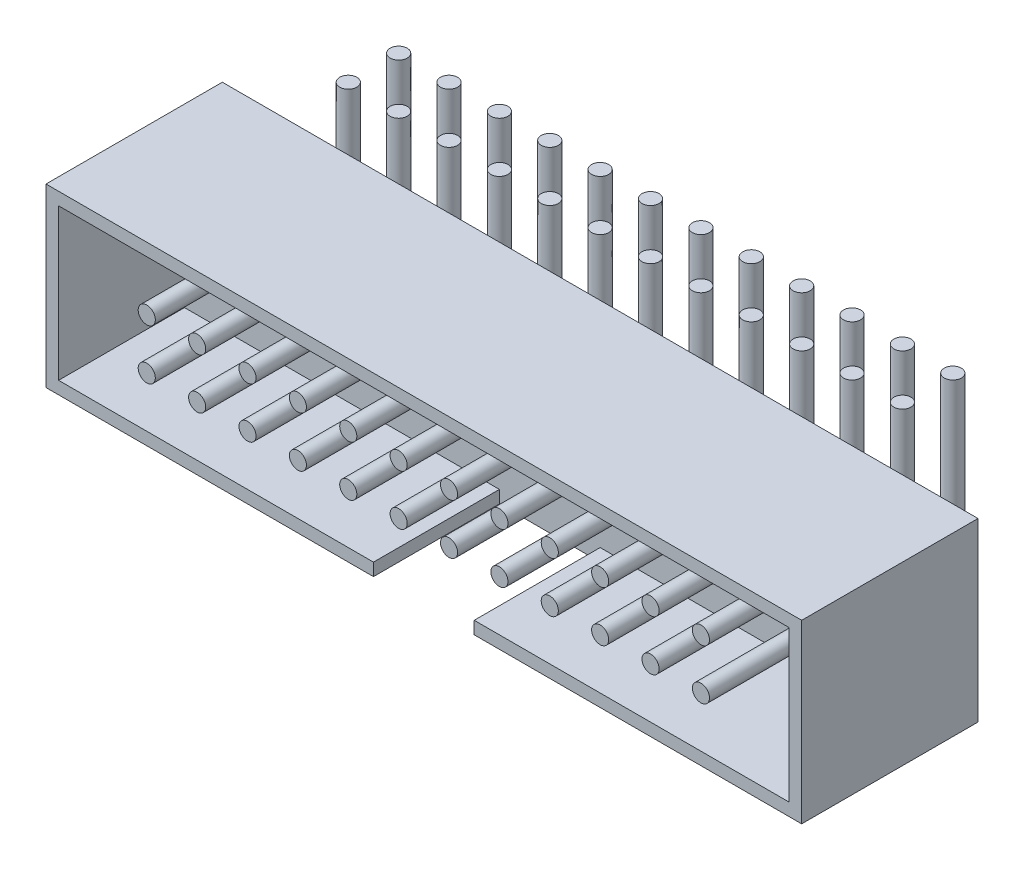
from build123d import *

# Parameters (mm, degrees)
SKETCH1_W                   = 38.1
SKETCH1_H                   = 8.89
BOSS_EXTRUDE1_DEPTH         = 2.54
SKETCH4_W                   = 0.635
SKETCH4_H                   = 8.89
BOSS_EXTRUDE2_DEPTH         = 6.35
SKETCH5_W                   = 36.83
SKETCH5_H                   = 0.635
SKETCH5_W_2                 = 15.875
BOSS_EXTRUDE3_DEPTH         = 6.35
BOSS_EXTRUDE4_DEPTH         = 3.81
BOSS_EXTRUDE4_DEPTH_BACK    = 8.89
SKETCH6_R                   = 0.4318
BOSS_EXTRUDE4_2_DEPTH       = 3.81
BOSS_EXTRUDE4_2_DEPTH_BACK  = 8.89
BOSS_EXTRUDE4_3_DEPTH       = 3.81
BOSS_EXTRUDE4_3_DEPTH_BACK  = 8.89
BOSS_EXTRUDE4_4_DEPTH       = 3.81
BOSS_EXTRUDE4_4_DEPTH_BACK  = 8.89
BOSS_EXTRUDE4_5_DEPTH       = 3.81
BOSS_EXTRUDE4_5_DEPTH_BACK  = 8.89
BOSS_EXTRUDE4_6_DEPTH       = 3.81
BOSS_EXTRUDE4_6_DEPTH_BACK  = 8.89
BOSS_EXTRUDE4_7_DEPTH       = 3.81
BOSS_EXTRUDE4_7_DEPTH_BACK  = 8.89
BOSS_EXTRUDE4_8_DEPTH       = 3.81
BOSS_EXTRUDE4_8_DEPTH_BACK  = 8.89
BOSS_EXTRUDE4_9_DEPTH       = 3.81
BOSS_EXTRUDE4_9_DEPTH_BACK  = 8.89
BOSS_EXTRUDE4_10_DEPTH      = 3.81
BOSS_EXTRUDE4_10_DEPTH_BACK = 8.89
BOSS_EXTRUDE4_11_DEPTH      = 3.81
BOSS_EXTRUDE4_11_DEPTH_BACK = 8.89
BOSS_EXTRUDE4_12_DEPTH      = 3.81
BOSS_EXTRUDE4_12_DEPTH_BACK = 8.89
BOSS_EXTRUDE5_DEPTH         = 1.27
BOSS_EXTRUDE5_DEPTH_BACK    = 8.89
SKETCH7_R                   = 0.4318
BOSS_EXTRUDE5_2_DEPTH       = 1.27
BOSS_EXTRUDE5_2_DEPTH_BACK  = 8.89
BOSS_EXTRUDE5_3_DEPTH       = 1.27
BOSS_EXTRUDE5_3_DEPTH_BACK  = 8.89
BOSS_EXTRUDE5_4_DEPTH       = 1.27
BOSS_EXTRUDE5_4_DEPTH_BACK  = 8.89
BOSS_EXTRUDE5_5_DEPTH       = 1.27
BOSS_EXTRUDE5_5_DEPTH_BACK  = 8.89
BOSS_EXTRUDE5_6_DEPTH       = 1.27
BOSS_EXTRUDE5_6_DEPTH_BACK  = 8.89
BOSS_EXTRUDE5_7_DEPTH       = 1.27
BOSS_EXTRUDE5_7_DEPTH_BACK  = 8.89
BOSS_EXTRUDE5_8_DEPTH       = 1.27
BOSS_EXTRUDE5_8_DEPTH_BACK  = 8.89
BOSS_EXTRUDE5_9_DEPTH       = 1.27
BOSS_EXTRUDE5_9_DEPTH_BACK  = 8.89
BOSS_EXTRUDE5_10_DEPTH      = 1.27
BOSS_EXTRUDE5_10_DEPTH_BACK = 8.89
BOSS_EXTRUDE5_11_DEPTH      = 1.27
BOSS_EXTRUDE5_11_DEPTH_BACK = 8.89
BOSS_EXTRUDE5_12_DEPTH      = 1.27
BOSS_EXTRUDE5_12_DEPTH_BACK = 8.89
F_3DSKETCH3_R               = 0.4318
BOSS_EXTRUDE6_DEPTH         = 7.62
BOSS_EXTRUDE6_2_DEPTH       = 7.62
BOSS_EXTRUDE6_3_DEPTH       = 7.62
BOSS_EXTRUDE6_4_DEPTH       = 7.62
BOSS_EXTRUDE6_5_DEPTH       = 7.62
BOSS_EXTRUDE6_6_DEPTH       = 7.62
BOSS_EXTRUDE6_7_DEPTH       = 7.62
BOSS_EXTRUDE6_8_DEPTH       = 7.62
BOSS_EXTRUDE6_9_DEPTH       = 7.62
BOSS_EXTRUDE6_10_DEPTH      = 7.62
BOSS_EXTRUDE6_11_DEPTH      = 7.62
BOSS_EXTRUDE6_12_DEPTH      = 7.62
DOME9_FACE_RADIUS           = 0.4318
DOME9_HEIGHT                = 0.4318
DOME10_FACE_RADIUS          = 0.4318
DOME10_HEIGHT               = 0.4318
DOME11_FACE_RADIUS          = 0.4318
DOME11_HEIGHT               = 0.4318
DOME12_FACE_RADIUS          = 0.4318
DOME12_HEIGHT               = 0.4318
DOME13_FACE_RADIUS          = 0.4318
DOME13_HEIGHT               = 0.4318
DOME14_FACE_RADIUS          = 0.4318
DOME14_HEIGHT               = 0.4318
DOME15_FACE_RADIUS          = 0.4318
DOME15_HEIGHT               = 0.4318
DOME16_FACE_RADIUS          = 0.4318
DOME16_HEIGHT               = 0.4318
DOME17_FACE_RADIUS          = 0.4318
DOME17_HEIGHT               = 0.4318
DOME18_FACE_RADIUS          = 0.4318
DOME18_HEIGHT               = 0.4318
DOME19_FACE_RADIUS          = 0.4318
DOME19_HEIGHT               = 0.4318
DOME20_FACE_RADIUS          = 0.4318
DOME20_HEIGHT               = 0.4318
F_3DSKETCH7_R               = 0.4318
BOSS_EXTRUDE7_DEPTH         = 5.08
BOSS_EXTRUDE7_2_DEPTH       = 5.08
BOSS_EXTRUDE7_3_DEPTH       = 5.08
BOSS_EXTRUDE7_4_DEPTH       = 5.08
BOSS_EXTRUDE7_5_DEPTH       = 5.08
BOSS_EXTRUDE7_6_DEPTH       = 5.08
BOSS_EXTRUDE7_7_DEPTH       = 5.08
BOSS_EXTRUDE7_8_DEPTH       = 5.08
BOSS_EXTRUDE7_9_DEPTH       = 5.08
BOSS_EXTRUDE7_10_DEPTH      = 5.08
BOSS_EXTRUDE7_11_DEPTH      = 5.08
BOSS_EXTRUDE7_12_DEPTH      = 5.08
DOME22_FACE_RADIUS          = 0.4318
DOME22_HEIGHT               = 0.4318
DOME23_FACE_RADIUS          = 0.4318
DOME23_HEIGHT               = 0.4318
DOME24_FACE_RADIUS          = 0.4318
DOME24_HEIGHT               = 0.4318
DOME25_FACE_RADIUS          = 0.4318
DOME25_HEIGHT               = 0.4318
DOME26_FACE_RADIUS          = 0.4318
DOME26_HEIGHT               = 0.4318
DOME27_FACE_RADIUS          = 0.4318
DOME27_HEIGHT               = 0.4318
DOME28_FACE_RADIUS          = 0.4318
DOME28_HEIGHT               = 0.4318
DOME29_FACE_RADIUS          = 0.4318
DOME29_HEIGHT               = 0.4318
DOME30_FACE_RADIUS          = 0.4318
DOME30_HEIGHT               = 0.4318
DOME31_FACE_RADIUS          = 0.4318
DOME31_HEIGHT               = 0.4318
DOME32_FACE_RADIUS          = 0.4318
DOME32_HEIGHT               = 0.4318
DOME33_FACE_RADIUS          = 0.4318
DOME33_HEIGHT               = 0.4318


with BuildPart() as part:
    # Sketch1 → Boss-Extrude1 (new body)
    with BuildSketch(Plane.XY):
        with Locations((13.97, 1.27)):
            Rectangle(SKETCH1_W, SKETCH1_H)
    extrude(amount=BOSS_EXTRUDE1_DEPTH)

    # Sketch4 → Boss-Extrude2 (add)
    with BuildSketch(Plane.XY.offset(2.54)):
        with Locations((-4.7625, 1.27)):
            Rectangle(SKETCH4_W, SKETCH4_H)
        with Locations((32.7025, 1.27)):
            Rectangle(SKETCH4_W, SKETCH4_H)
    extrude(amount=BOSS_EXTRUDE2_DEPTH)

    # Sketch5 → Boss-Extrude3 (add)
    with BuildSketch(Plane.XY.offset(2.54)):
        with Locations((13.97, 5.3975)):
            Rectangle(SKETCH5_W, SKETCH5_H)
        with Locations((3.4925, -2.8575)):
            Rectangle(SKETCH5_W_2, SKETCH5_H)
        with Locations((24.4475, -2.8575)):
            Rectangle(SKETCH5_W_2, SKETCH5_H)
    extrude(amount=BOSS_EXTRUDE3_DEPTH)


with BuildPart() as body_2:
    # Sketch6 → Boss-Extrude4 (new, two sides: drawn at the far end of the back side and taken through both)
    with BuildSketch(Plane(origin=(0, 0, 0), x_dir=(-1, 0, 0), z_dir=(0, 0, -1)).offset(-BOSS_EXTRUDE4_DEPTH_BACK)):
        Circle(SKETCH6_R)
    extrude(amount=BOSS_EXTRUDE4_DEPTH + BOSS_EXTRUDE4_DEPTH_BACK)

    # Dome9: a dome of height H over a round flat face of radius A is a cap of a sphere of radius (A * A + H * H) / (2 * H)
    dome9_r = (DOME9_FACE_RADIUS * DOME9_FACE_RADIUS + DOME9_HEIGHT * DOME9_HEIGHT) / (2 * DOME9_HEIGHT)
    dome9_base = Plane((0, 0, -3.81), z_dir=(0, 0, -1))
    with Locations(dome9_base.offset(DOME9_HEIGHT - dome9_r)):
        dome9_ball = Sphere(dome9_r, mode=Mode.PRIVATE)
    add(split(dome9_ball, bisect_by=dome9_base, keep=Keep.TOP, mode=Mode.PRIVATE))


with BuildPart() as body_3:
    # Sketch6 → Boss-Extrude4 2 (new, two sides: drawn at the far end of the back side and taken through both)
    with BuildSketch(Plane(origin=(0, 0, 0), x_dir=(-1, 0, 0), z_dir=(0, 0, -1)).offset(-BOSS_EXTRUDE4_2_DEPTH_BACK)):
        with Locations((-2.54, 0)):
            Circle(SKETCH6_R)
    extrude(amount=BOSS_EXTRUDE4_2_DEPTH + BOSS_EXTRUDE4_2_DEPTH_BACK)

    # Dome10: a dome of height H over a round flat face of radius A is a cap of a sphere of radius (A * A + H * H) / (2 * H)
    dome10_r = (DOME10_FACE_RADIUS * DOME10_FACE_RADIUS + DOME10_HEIGHT * DOME10_HEIGHT) / (2 * DOME10_HEIGHT)
    dome10_base = Plane((2.54, 0, -3.81), z_dir=(0, 0, -1))
    with Locations(dome10_base.offset(DOME10_HEIGHT - dome10_r)):
        dome10_ball = Sphere(dome10_r, mode=Mode.PRIVATE)
    add(split(dome10_ball, bisect_by=dome10_base, keep=Keep.TOP, mode=Mode.PRIVATE))


with BuildPart() as body_4:
    # Sketch6 → Boss-Extrude4 3 (new, two sides: drawn at the far end of the back side and taken through both)
    with BuildSketch(Plane(origin=(0, 0, 0), x_dir=(-1, 0, 0), z_dir=(0, 0, -1)).offset(-BOSS_EXTRUDE4_3_DEPTH_BACK)):
        with Locations((-5.08, 0)):
            Circle(SKETCH6_R)
    extrude(amount=BOSS_EXTRUDE4_3_DEPTH + BOSS_EXTRUDE4_3_DEPTH_BACK)

    # Dome12: a dome of height H over a round flat face of radius A is a cap of a sphere of radius (A * A + H * H) / (2 * H)
    dome12_r = (DOME12_FACE_RADIUS * DOME12_FACE_RADIUS + DOME12_HEIGHT * DOME12_HEIGHT) / (2 * DOME12_HEIGHT)
    dome12_base = Plane((5.08, 0, -3.81), z_dir=(0, 0, -1))
    with Locations(dome12_base.offset(DOME12_HEIGHT - dome12_r)):
        dome12_ball = Sphere(dome12_r, mode=Mode.PRIVATE)
    add(split(dome12_ball, bisect_by=dome12_base, keep=Keep.TOP, mode=Mode.PRIVATE))


with BuildPart() as body_5:
    # Sketch6 → Boss-Extrude4 4 (new, two sides: drawn at the far end of the back side and taken through both)
    with BuildSketch(Plane(origin=(0, 0, 0), x_dir=(-1, 0, 0), z_dir=(0, 0, -1)).offset(-BOSS_EXTRUDE4_4_DEPTH_BACK)):
        with Locations((-7.62, 0)):
            Circle(SKETCH6_R)
    extrude(amount=BOSS_EXTRUDE4_4_DEPTH + BOSS_EXTRUDE4_4_DEPTH_BACK)

    # Dome11: a dome of height H over a round flat face of radius A is a cap of a sphere of radius (A * A + H * H) / (2 * H)
    dome11_r = (DOME11_FACE_RADIUS * DOME11_FACE_RADIUS + DOME11_HEIGHT * DOME11_HEIGHT) / (2 * DOME11_HEIGHT)
    dome11_base = Plane((7.62, 0, -3.81), z_dir=(0, 0, -1))
    with Locations(dome11_base.offset(DOME11_HEIGHT - dome11_r)):
        dome11_ball = Sphere(dome11_r, mode=Mode.PRIVATE)
    add(split(dome11_ball, bisect_by=dome11_base, keep=Keep.TOP, mode=Mode.PRIVATE))


with BuildPart() as body_6:
    # Sketch6 → Boss-Extrude4 5 (new, two sides: drawn at the far end of the back side and taken through both)
    with BuildSketch(Plane(origin=(0, 0, 0), x_dir=(-1, 0, 0), z_dir=(0, 0, -1)).offset(-BOSS_EXTRUDE4_5_DEPTH_BACK)):
        with Locations((-10.16, 0)):
            Circle(SKETCH6_R)
    extrude(amount=BOSS_EXTRUDE4_5_DEPTH + BOSS_EXTRUDE4_5_DEPTH_BACK)

    # Dome13: a dome of height H over a round flat face of radius A is a cap of a sphere of radius (A * A + H * H) / (2 * H)
    dome13_r = (DOME13_FACE_RADIUS * DOME13_FACE_RADIUS + DOME13_HEIGHT * DOME13_HEIGHT) / (2 * DOME13_HEIGHT)
    dome13_base = Plane((10.16, 0, -3.81), z_dir=(0, 0, -1))
    with Locations(dome13_base.offset(DOME13_HEIGHT - dome13_r)):
        dome13_ball = Sphere(dome13_r, mode=Mode.PRIVATE)
    add(split(dome13_ball, bisect_by=dome13_base, keep=Keep.TOP, mode=Mode.PRIVATE))


with BuildPart() as body_7:
    # Sketch6 → Boss-Extrude4 6 (new, two sides: drawn at the far end of the back side and taken through both)
    with BuildSketch(Plane(origin=(0, 0, 0), x_dir=(-1, 0, 0), z_dir=(0, 0, -1)).offset(-BOSS_EXTRUDE4_6_DEPTH_BACK)):
        with Locations((-12.7, 0)):
            Circle(SKETCH6_R)
    extrude(amount=BOSS_EXTRUDE4_6_DEPTH + BOSS_EXTRUDE4_6_DEPTH_BACK)

    # Dome14: a dome of height H over a round flat face of radius A is a cap of a sphere of radius (A * A + H * H) / (2 * H)
    dome14_r = (DOME14_FACE_RADIUS * DOME14_FACE_RADIUS + DOME14_HEIGHT * DOME14_HEIGHT) / (2 * DOME14_HEIGHT)
    dome14_base = Plane((12.7, 0, -3.81), z_dir=(0, 0, -1))
    with Locations(dome14_base.offset(DOME14_HEIGHT - dome14_r)):
        dome14_ball = Sphere(dome14_r, mode=Mode.PRIVATE)
    add(split(dome14_ball, bisect_by=dome14_base, keep=Keep.TOP, mode=Mode.PRIVATE))


with BuildPart() as body_8:
    # Sketch6 → Boss-Extrude4 7 (new, two sides: drawn at the far end of the back side and taken through both)
    with BuildSketch(Plane(origin=(0, 0, 0), x_dir=(-1, 0, 0), z_dir=(0, 0, -1)).offset(-BOSS_EXTRUDE4_7_DEPTH_BACK)):
        with Locations((-15.24, 0)):
            Circle(SKETCH6_R)
    extrude(amount=BOSS_EXTRUDE4_7_DEPTH + BOSS_EXTRUDE4_7_DEPTH_BACK)

    # Dome15: a dome of height H over a round flat face of radius A is a cap of a sphere of radius (A * A + H * H) / (2 * H)
    dome15_r = (DOME15_FACE_RADIUS * DOME15_FACE_RADIUS + DOME15_HEIGHT * DOME15_HEIGHT) / (2 * DOME15_HEIGHT)
    dome15_base = Plane((15.24, 0, -3.81), z_dir=(0, 0, -1))
    with Locations(dome15_base.offset(DOME15_HEIGHT - dome15_r)):
        dome15_ball = Sphere(dome15_r, mode=Mode.PRIVATE)
    add(split(dome15_ball, bisect_by=dome15_base, keep=Keep.TOP, mode=Mode.PRIVATE))


with BuildPart() as body_9:
    # Sketch6 → Boss-Extrude4 8 (new, two sides: drawn at the far end of the back side and taken through both)
    with BuildSketch(Plane(origin=(0, 0, 0), x_dir=(-1, 0, 0), z_dir=(0, 0, -1)).offset(-BOSS_EXTRUDE4_8_DEPTH_BACK)):
        with Locations((-17.78, 0)):
            Circle(SKETCH6_R)
    extrude(amount=BOSS_EXTRUDE4_8_DEPTH + BOSS_EXTRUDE4_8_DEPTH_BACK)

    # Dome16: a dome of height H over a round flat face of radius A is a cap of a sphere of radius (A * A + H * H) / (2 * H)
    dome16_r = (DOME16_FACE_RADIUS * DOME16_FACE_RADIUS + DOME16_HEIGHT * DOME16_HEIGHT) / (2 * DOME16_HEIGHT)
    dome16_base = Plane((17.78, 0, -3.81), z_dir=(0, 0, -1))
    with Locations(dome16_base.offset(DOME16_HEIGHT - dome16_r)):
        dome16_ball = Sphere(dome16_r, mode=Mode.PRIVATE)
    add(split(dome16_ball, bisect_by=dome16_base, keep=Keep.TOP, mode=Mode.PRIVATE))


with BuildPart() as body_10:
    # Sketch6 → Boss-Extrude4 9 (new, two sides: drawn at the far end of the back side and taken through both)
    with BuildSketch(Plane(origin=(0, 0, 0), x_dir=(-1, 0, 0), z_dir=(0, 0, -1)).offset(-BOSS_EXTRUDE4_9_DEPTH_BACK)):
        with Locations((-20.32, 0)):
            Circle(SKETCH6_R)
    extrude(amount=BOSS_EXTRUDE4_9_DEPTH + BOSS_EXTRUDE4_9_DEPTH_BACK)

    # Dome17: a dome of height H over a round flat face of radius A is a cap of a sphere of radius (A * A + H * H) / (2 * H)
    dome17_r = (DOME17_FACE_RADIUS * DOME17_FACE_RADIUS + DOME17_HEIGHT * DOME17_HEIGHT) / (2 * DOME17_HEIGHT)
    dome17_base = Plane((20.32, 0, -3.81), z_dir=(0, 0, -1))
    with Locations(dome17_base.offset(DOME17_HEIGHT - dome17_r)):
        dome17_ball = Sphere(dome17_r, mode=Mode.PRIVATE)
    add(split(dome17_ball, bisect_by=dome17_base, keep=Keep.TOP, mode=Mode.PRIVATE))


with BuildPart() as body_11:
    # Sketch6 → Boss-Extrude4 10 (new, two sides: drawn at the far end of the back side and taken through both)
    with BuildSketch(Plane(origin=(0, 0, 0), x_dir=(-1, 0, 0), z_dir=(0, 0, -1)).offset(-BOSS_EXTRUDE4_10_DEPTH_BACK)):
        with Locations((-22.86, 0)):
            Circle(SKETCH6_R)
    extrude(amount=BOSS_EXTRUDE4_10_DEPTH + BOSS_EXTRUDE4_10_DEPTH_BACK)

    # Dome18: a dome of height H over a round flat face of radius A is a cap of a sphere of radius (A * A + H * H) / (2 * H)
    dome18_r = (DOME18_FACE_RADIUS * DOME18_FACE_RADIUS + DOME18_HEIGHT * DOME18_HEIGHT) / (2 * DOME18_HEIGHT)
    dome18_base = Plane((22.86, 0, -3.81), z_dir=(0, 0, -1))
    with Locations(dome18_base.offset(DOME18_HEIGHT - dome18_r)):
        dome18_ball = Sphere(dome18_r, mode=Mode.PRIVATE)
    add(split(dome18_ball, bisect_by=dome18_base, keep=Keep.TOP, mode=Mode.PRIVATE))


with BuildPart() as body_12:
    # Sketch6 → Boss-Extrude4 11 (new, two sides: drawn at the far end of the back side and taken through both)
    with BuildSketch(Plane(origin=(0, 0, 0), x_dir=(-1, 0, 0), z_dir=(0, 0, -1)).offset(-BOSS_EXTRUDE4_11_DEPTH_BACK)):
        with Locations((-25.4, 0)):
            Circle(SKETCH6_R)
    extrude(amount=BOSS_EXTRUDE4_11_DEPTH + BOSS_EXTRUDE4_11_DEPTH_BACK)

    # Dome19: a dome of height H over a round flat face of radius A is a cap of a sphere of radius (A * A + H * H) / (2 * H)
    dome19_r = (DOME19_FACE_RADIUS * DOME19_FACE_RADIUS + DOME19_HEIGHT * DOME19_HEIGHT) / (2 * DOME19_HEIGHT)
    dome19_base = Plane((25.4, 0, -3.81), z_dir=(0, 0, -1))
    with Locations(dome19_base.offset(DOME19_HEIGHT - dome19_r)):
        dome19_ball = Sphere(dome19_r, mode=Mode.PRIVATE)
    add(split(dome19_ball, bisect_by=dome19_base, keep=Keep.TOP, mode=Mode.PRIVATE))


with BuildPart() as body_13:
    # Sketch6 → Boss-Extrude4 12 (new, two sides: drawn at the far end of the back side and taken through both)
    with BuildSketch(Plane(origin=(0, 0, 0), x_dir=(-1, 0, 0), z_dir=(0, 0, -1)).offset(-BOSS_EXTRUDE4_12_DEPTH_BACK)):
        with Locations((-27.94, 0)):
            Circle(SKETCH6_R)
    extrude(amount=BOSS_EXTRUDE4_12_DEPTH + BOSS_EXTRUDE4_12_DEPTH_BACK)

    # Dome20: a dome of height H over a round flat face of radius A is a cap of a sphere of radius (A * A + H * H) / (2 * H)
    dome20_r = (DOME20_FACE_RADIUS * DOME20_FACE_RADIUS + DOME20_HEIGHT * DOME20_HEIGHT) / (2 * DOME20_HEIGHT)
    dome20_base = Plane((27.94, 0, -3.81), z_dir=(0, 0, -1))
    with Locations(dome20_base.offset(DOME20_HEIGHT - dome20_r)):
        dome20_ball = Sphere(dome20_r, mode=Mode.PRIVATE)
    add(split(dome20_ball, bisect_by=dome20_base, keep=Keep.TOP, mode=Mode.PRIVATE))


with BuildPart() as body_14:
    # Sketch7 → Boss-Extrude5 (new, two sides: drawn at the far end of the back side and taken through both)
    with BuildSketch(Plane(origin=(0, 0, 0), x_dir=(-1, 0, 0), z_dir=(0, 0, -1)).offset(-BOSS_EXTRUDE5_DEPTH_BACK)):
        with Locations((0, 2.54)):
            Circle(SKETCH7_R)
    extrude(amount=BOSS_EXTRUDE5_DEPTH + BOSS_EXTRUDE5_DEPTH_BACK)

    # Dome22: a dome of height H over a round flat face of radius A is a cap of a sphere of radius (A * A + H * H) / (2 * H)
    dome22_r = (DOME22_FACE_RADIUS * DOME22_FACE_RADIUS + DOME22_HEIGHT * DOME22_HEIGHT) / (2 * DOME22_HEIGHT)
    dome22_base = Plane((0, 2.54, -1.27), z_dir=(0, 0, -1))
    with Locations(dome22_base.offset(DOME22_HEIGHT - dome22_r)):
        dome22_ball = Sphere(dome22_r, mode=Mode.PRIVATE)
    add(split(dome22_ball, bisect_by=dome22_base, keep=Keep.TOP, mode=Mode.PRIVATE))


with BuildPart() as body_15:
    # Sketch7 → Boss-Extrude5 2 (new, two sides: drawn at the far end of the back side and taken through both)
    with BuildSketch(Plane(origin=(0, 0, 0), x_dir=(-1, 0, 0), z_dir=(0, 0, -1)).offset(-BOSS_EXTRUDE5_2_DEPTH_BACK)):
        with Locations((-2.54, 2.54)):
            Circle(SKETCH7_R)
    extrude(amount=BOSS_EXTRUDE5_2_DEPTH + BOSS_EXTRUDE5_2_DEPTH_BACK)

    # Dome23: a dome of height H over a round flat face of radius A is a cap of a sphere of radius (A * A + H * H) / (2 * H)
    dome23_r = (DOME23_FACE_RADIUS * DOME23_FACE_RADIUS + DOME23_HEIGHT * DOME23_HEIGHT) / (2 * DOME23_HEIGHT)
    dome23_base = Plane((2.54, 2.54, -1.27), z_dir=(0, 0, -1))
    with Locations(dome23_base.offset(DOME23_HEIGHT - dome23_r)):
        dome23_ball = Sphere(dome23_r, mode=Mode.PRIVATE)
    add(split(dome23_ball, bisect_by=dome23_base, keep=Keep.TOP, mode=Mode.PRIVATE))


with BuildPart() as body_16:
    # Sketch7 → Boss-Extrude5 3 (new, two sides: drawn at the far end of the back side and taken through both)
    with BuildSketch(Plane(origin=(0, 0, 0), x_dir=(-1, 0, 0), z_dir=(0, 0, -1)).offset(-BOSS_EXTRUDE5_3_DEPTH_BACK)):
        with Locations((-5.08, 2.54)):
            Circle(SKETCH7_R)
    extrude(amount=BOSS_EXTRUDE5_3_DEPTH + BOSS_EXTRUDE5_3_DEPTH_BACK)

    # Dome24: a dome of height H over a round flat face of radius A is a cap of a sphere of radius (A * A + H * H) / (2 * H)
    dome24_r = (DOME24_FACE_RADIUS * DOME24_FACE_RADIUS + DOME24_HEIGHT * DOME24_HEIGHT) / (2 * DOME24_HEIGHT)
    dome24_base = Plane((5.08, 2.54, -1.27), z_dir=(0, 0, -1))
    with Locations(dome24_base.offset(DOME24_HEIGHT - dome24_r)):
        dome24_ball = Sphere(dome24_r, mode=Mode.PRIVATE)
    add(split(dome24_ball, bisect_by=dome24_base, keep=Keep.TOP, mode=Mode.PRIVATE))


with BuildPart() as body_17:
    # Sketch7 → Boss-Extrude5 4 (new, two sides: drawn at the far end of the back side and taken through both)
    with BuildSketch(Plane(origin=(0, 0, 0), x_dir=(-1, 0, 0), z_dir=(0, 0, -1)).offset(-BOSS_EXTRUDE5_4_DEPTH_BACK)):
        with Locations((-7.62, 2.54)):
            Circle(SKETCH7_R)
    extrude(amount=BOSS_EXTRUDE5_4_DEPTH + BOSS_EXTRUDE5_4_DEPTH_BACK)

    # Dome25: a dome of height H over a round flat face of radius A is a cap of a sphere of radius (A * A + H * H) / (2 * H)
    dome25_r = (DOME25_FACE_RADIUS * DOME25_FACE_RADIUS + DOME25_HEIGHT * DOME25_HEIGHT) / (2 * DOME25_HEIGHT)
    dome25_base = Plane((7.62, 2.54, -1.27), z_dir=(0, 0, -1))
    with Locations(dome25_base.offset(DOME25_HEIGHT - dome25_r)):
        dome25_ball = Sphere(dome25_r, mode=Mode.PRIVATE)
    add(split(dome25_ball, bisect_by=dome25_base, keep=Keep.TOP, mode=Mode.PRIVATE))


with BuildPart() as body_18:
    # Sketch7 → Boss-Extrude5 5 (new, two sides: drawn at the far end of the back side and taken through both)
    with BuildSketch(Plane(origin=(0, 0, 0), x_dir=(-1, 0, 0), z_dir=(0, 0, -1)).offset(-BOSS_EXTRUDE5_5_DEPTH_BACK)):
        with Locations((-10.16, 2.54)):
            Circle(SKETCH7_R)
    extrude(amount=BOSS_EXTRUDE5_5_DEPTH + BOSS_EXTRUDE5_5_DEPTH_BACK)

    # Dome26: a dome of height H over a round flat face of radius A is a cap of a sphere of radius (A * A + H * H) / (2 * H)
    dome26_r = (DOME26_FACE_RADIUS * DOME26_FACE_RADIUS + DOME26_HEIGHT * DOME26_HEIGHT) / (2 * DOME26_HEIGHT)
    dome26_base = Plane((10.16, 2.54, -1.27), z_dir=(0, 0, -1))
    with Locations(dome26_base.offset(DOME26_HEIGHT - dome26_r)):
        dome26_ball = Sphere(dome26_r, mode=Mode.PRIVATE)
    add(split(dome26_ball, bisect_by=dome26_base, keep=Keep.TOP, mode=Mode.PRIVATE))


with BuildPart() as body_19:
    # Sketch7 → Boss-Extrude5 6 (new, two sides: drawn at the far end of the back side and taken through both)
    with BuildSketch(Plane(origin=(0, 0, 0), x_dir=(-1, 0, 0), z_dir=(0, 0, -1)).offset(-BOSS_EXTRUDE5_6_DEPTH_BACK)):
        with Locations((-12.7, 2.54)):
            Circle(SKETCH7_R)
    extrude(amount=BOSS_EXTRUDE5_6_DEPTH + BOSS_EXTRUDE5_6_DEPTH_BACK)

    # Dome27: a dome of height H over a round flat face of radius A is a cap of a sphere of radius (A * A + H * H) / (2 * H)
    dome27_r = (DOME27_FACE_RADIUS * DOME27_FACE_RADIUS + DOME27_HEIGHT * DOME27_HEIGHT) / (2 * DOME27_HEIGHT)
    dome27_base = Plane((12.7, 2.54, -1.27), z_dir=(0, 0, -1))
    with Locations(dome27_base.offset(DOME27_HEIGHT - dome27_r)):
        dome27_ball = Sphere(dome27_r, mode=Mode.PRIVATE)
    add(split(dome27_ball, bisect_by=dome27_base, keep=Keep.TOP, mode=Mode.PRIVATE))


with BuildPart() as body_20:
    # Sketch7 → Boss-Extrude5 7 (new, two sides: drawn at the far end of the back side and taken through both)
    with BuildSketch(Plane(origin=(0, 0, 0), x_dir=(-1, 0, 0), z_dir=(0, 0, -1)).offset(-BOSS_EXTRUDE5_7_DEPTH_BACK)):
        with Locations((-15.24, 2.54)):
            Circle(SKETCH7_R)
    extrude(amount=BOSS_EXTRUDE5_7_DEPTH + BOSS_EXTRUDE5_7_DEPTH_BACK)

    # Dome28: a dome of height H over a round flat face of radius A is a cap of a sphere of radius (A * A + H * H) / (2 * H)
    dome28_r = (DOME28_FACE_RADIUS * DOME28_FACE_RADIUS + DOME28_HEIGHT * DOME28_HEIGHT) / (2 * DOME28_HEIGHT)
    dome28_base = Plane((15.24, 2.54, -1.27), z_dir=(0, 0, -1))
    with Locations(dome28_base.offset(DOME28_HEIGHT - dome28_r)):
        dome28_ball = Sphere(dome28_r, mode=Mode.PRIVATE)
    add(split(dome28_ball, bisect_by=dome28_base, keep=Keep.TOP, mode=Mode.PRIVATE))


with BuildPart() as body_21:
    # Sketch7 → Boss-Extrude5 8 (new, two sides: drawn at the far end of the back side and taken through both)
    with BuildSketch(Plane(origin=(0, 0, 0), x_dir=(-1, 0, 0), z_dir=(0, 0, -1)).offset(-BOSS_EXTRUDE5_8_DEPTH_BACK)):
        with Locations((-17.78, 2.54)):
            Circle(SKETCH7_R)
    extrude(amount=BOSS_EXTRUDE5_8_DEPTH + BOSS_EXTRUDE5_8_DEPTH_BACK)

    # Dome29: a dome of height H over a round flat face of radius A is a cap of a sphere of radius (A * A + H * H) / (2 * H)
    dome29_r = (DOME29_FACE_RADIUS * DOME29_FACE_RADIUS + DOME29_HEIGHT * DOME29_HEIGHT) / (2 * DOME29_HEIGHT)
    dome29_base = Plane((17.78, 2.54, -1.27), z_dir=(0, 0, -1))
    with Locations(dome29_base.offset(DOME29_HEIGHT - dome29_r)):
        dome29_ball = Sphere(dome29_r, mode=Mode.PRIVATE)
    add(split(dome29_ball, bisect_by=dome29_base, keep=Keep.TOP, mode=Mode.PRIVATE))


with BuildPart() as body_22:
    # Sketch7 → Boss-Extrude5 9 (new, two sides: drawn at the far end of the back side and taken through both)
    with BuildSketch(Plane(origin=(0, 0, 0), x_dir=(-1, 0, 0), z_dir=(0, 0, -1)).offset(-BOSS_EXTRUDE5_9_DEPTH_BACK)):
        with Locations((-20.32, 2.54)):
            Circle(SKETCH7_R)
    extrude(amount=BOSS_EXTRUDE5_9_DEPTH + BOSS_EXTRUDE5_9_DEPTH_BACK)

    # Dome30: a dome of height H over a round flat face of radius A is a cap of a sphere of radius (A * A + H * H) / (2 * H)
    dome30_r = (DOME30_FACE_RADIUS * DOME30_FACE_RADIUS + DOME30_HEIGHT * DOME30_HEIGHT) / (2 * DOME30_HEIGHT)
    dome30_base = Plane((20.32, 2.54, -1.27), z_dir=(0, 0, -1))
    with Locations(dome30_base.offset(DOME30_HEIGHT - dome30_r)):
        dome30_ball = Sphere(dome30_r, mode=Mode.PRIVATE)
    add(split(dome30_ball, bisect_by=dome30_base, keep=Keep.TOP, mode=Mode.PRIVATE))


with BuildPart() as body_23:
    # Sketch7 → Boss-Extrude5 10 (new, two sides: drawn at the far end of the back side and taken through both)
    with BuildSketch(Plane(origin=(0, 0, 0), x_dir=(-1, 0, 0), z_dir=(0, 0, -1)).offset(-BOSS_EXTRUDE5_10_DEPTH_BACK)):
        with Locations((-22.86, 2.54)):
            Circle(SKETCH7_R)
    extrude(amount=BOSS_EXTRUDE5_10_DEPTH + BOSS_EXTRUDE5_10_DEPTH_BACK)

    # Dome31: a dome of height H over a round flat face of radius A is a cap of a sphere of radius (A * A + H * H) / (2 * H)
    dome31_r = (DOME31_FACE_RADIUS * DOME31_FACE_RADIUS + DOME31_HEIGHT * DOME31_HEIGHT) / (2 * DOME31_HEIGHT)
    dome31_base = Plane((22.86, 2.54, -1.27), z_dir=(0, 0, -1))
    with Locations(dome31_base.offset(DOME31_HEIGHT - dome31_r)):
        dome31_ball = Sphere(dome31_r, mode=Mode.PRIVATE)
    add(split(dome31_ball, bisect_by=dome31_base, keep=Keep.TOP, mode=Mode.PRIVATE))


with BuildPart() as body_24:
    # Sketch7 → Boss-Extrude5 11 (new, two sides: drawn at the far end of the back side and taken through both)
    with BuildSketch(Plane(origin=(0, 0, 0), x_dir=(-1, 0, 0), z_dir=(0, 0, -1)).offset(-BOSS_EXTRUDE5_11_DEPTH_BACK)):
        with Locations((-25.4, 2.54)):
            Circle(SKETCH7_R)
    extrude(amount=BOSS_EXTRUDE5_11_DEPTH + BOSS_EXTRUDE5_11_DEPTH_BACK)

    # Dome32: a dome of height H over a round flat face of radius A is a cap of a sphere of radius (A * A + H * H) / (2 * H)
    dome32_r = (DOME32_FACE_RADIUS * DOME32_FACE_RADIUS + DOME32_HEIGHT * DOME32_HEIGHT) / (2 * DOME32_HEIGHT)
    dome32_base = Plane((25.4, 2.54, -1.27), z_dir=(0, 0, -1))
    with Locations(dome32_base.offset(DOME32_HEIGHT - dome32_r)):
        dome32_ball = Sphere(dome32_r, mode=Mode.PRIVATE)
    add(split(dome32_ball, bisect_by=dome32_base, keep=Keep.TOP, mode=Mode.PRIVATE))


with BuildPart() as body_25:
    # Sketch7 → Boss-Extrude5 12 (new, two sides: drawn at the far end of the back side and taken through both)
    with BuildSketch(Plane(origin=(0, 0, 0), x_dir=(-1, 0, 0), z_dir=(0, 0, -1)).offset(-BOSS_EXTRUDE5_12_DEPTH_BACK)):
        with Locations((-27.94, 2.54)):
            Circle(SKETCH7_R)
    extrude(amount=BOSS_EXTRUDE5_12_DEPTH + BOSS_EXTRUDE5_12_DEPTH_BACK)

    # Dome33: a dome of height H over a round flat face of radius A is a cap of a sphere of radius (A * A + H * H) / (2 * H)
    dome33_r = (DOME33_FACE_RADIUS * DOME33_FACE_RADIUS + DOME33_HEIGHT * DOME33_HEIGHT) / (2 * DOME33_HEIGHT)
    dome33_base = Plane((27.94, 2.54, -1.27), z_dir=(0, 0, -1))
    with Locations(dome33_base.offset(DOME33_HEIGHT - dome33_r)):
        dome33_ball = Sphere(dome33_r, mode=Mode.PRIVATE)
    add(split(dome33_ball, bisect_by=dome33_base, keep=Keep.TOP, mode=Mode.PRIVATE))


with BuildPart() as body_26:
    # 3DSketch3 → Boss-Extrude6 (new body)
    with BuildSketch(Plane(origin=(0, 0, -3.81), x_dir=(1, 0, 0), z_dir=(0, -1, 0))):
        with Locations(Location((0, 0, 0), (0, 0, 90))):
            Circle(F_3DSKETCH3_R)
    extrude(amount=-BOSS_EXTRUDE6_DEPTH)


with BuildPart() as body_27:
    # 3DSketch3 → Boss-Extrude6 2 (new body)
    with BuildSketch(Plane(origin=(0, 0, -3.81), x_dir=(1, 0, 0), z_dir=(0, -1, 0))):
        with Locations(Location((2.54, 0, 0), (0, 0, 90))):
            Circle(F_3DSKETCH3_R)
    extrude(amount=-BOSS_EXTRUDE6_2_DEPTH)


with BuildPart() as body_28:
    # 3DSketch3 → Boss-Extrude6 3 (new body)
    with BuildSketch(Plane(origin=(0, 0, -3.81), x_dir=(1, 0, 0), z_dir=(0, -1, 0))):
        with Locations(Location((5.08, 0, 0), (0, 0, 90))):
            Circle(F_3DSKETCH3_R)
    extrude(amount=-BOSS_EXTRUDE6_3_DEPTH)


with BuildPart() as body_29:
    # 3DSketch3 → Boss-Extrude6 4 (new body)
    with BuildSketch(Plane(origin=(0, 0, -3.81), x_dir=(1, 0, 0), z_dir=(0, -1, 0))):
        with Locations(Location((7.62, 0, 0), (0, 0, 90))):
            Circle(F_3DSKETCH3_R)
    extrude(amount=-BOSS_EXTRUDE6_4_DEPTH)


with BuildPart() as body_30:
    # 3DSketch3 → Boss-Extrude6 5 (new body)
    with BuildSketch(Plane(origin=(0, 0, -3.81), x_dir=(1, 0, 0), z_dir=(0, -1, 0))):
        with Locations(Location((10.16, 0, 0), (0, 0, 90))):
            Circle(F_3DSKETCH3_R)
    extrude(amount=-BOSS_EXTRUDE6_5_DEPTH)


with BuildPart() as body_31:
    # 3DSketch3 → Boss-Extrude6 6 (new body)
    with BuildSketch(Plane(origin=(0, 0, -3.81), x_dir=(1, 0, 0), z_dir=(0, -1, 0))):
        with Locations(Location((12.7, 0, 0), (0, 0, 90))):
            Circle(F_3DSKETCH3_R)
    extrude(amount=-BOSS_EXTRUDE6_6_DEPTH)


with BuildPart() as body_32:
    # 3DSketch3 → Boss-Extrude6 7 (new body)
    with BuildSketch(Plane(origin=(0, 0, -3.81), x_dir=(1, 0, 0), z_dir=(0, -1, 0))):
        with Locations(Location((15.24, 0, 0), (0, 0, 90))):
            Circle(F_3DSKETCH3_R)
    extrude(amount=-BOSS_EXTRUDE6_7_DEPTH)


with BuildPart() as body_33:
    # 3DSketch3 → Boss-Extrude6 8 (new body)
    with BuildSketch(Plane(origin=(0, 0, -3.81), x_dir=(1, 0, 0), z_dir=(0, -1, 0))):
        with Locations(Location((17.78, 0, 0), (0, 0, 90))):
            Circle(F_3DSKETCH3_R)
    extrude(amount=-BOSS_EXTRUDE6_8_DEPTH)


with BuildPart() as body_34:
    # 3DSketch3 → Boss-Extrude6 9 (new body)
    with BuildSketch(Plane(origin=(0, 0, -3.81), x_dir=(1, 0, 0), z_dir=(0, -1, 0))):
        with Locations(Location((20.32, 0, 0), (0, 0, 90))):
            Circle(F_3DSKETCH3_R)
    extrude(amount=-BOSS_EXTRUDE6_9_DEPTH)


with BuildPart() as body_35:
    # 3DSketch3 → Boss-Extrude6 10 (new body)
    with BuildSketch(Plane(origin=(0, 0, -3.81), x_dir=(1, 0, 0), z_dir=(0, -1, 0))):
        with Locations(Location((22.86, 0, 0), (0, 0, 90))):
            Circle(F_3DSKETCH3_R)
    extrude(amount=-BOSS_EXTRUDE6_10_DEPTH)


with BuildPart() as body_36:
    # 3DSketch3 → Boss-Extrude6 11 (new body)
    with BuildSketch(Plane(origin=(0, 0, -3.81), x_dir=(1, 0, 0), z_dir=(0, -1, 0))):
        with Locations(Location((25.4, 0, 0), (0, 0, 90))):
            Circle(F_3DSKETCH3_R)
    extrude(amount=-BOSS_EXTRUDE6_11_DEPTH)


with BuildPart() as body_37:
    # 3DSketch3 → Boss-Extrude6 12 (new body)
    with BuildSketch(Plane(origin=(0, 0, -3.81), x_dir=(1, 0, 0), z_dir=(0, -1, 0))):
        with Locations(Location((27.94, 0, 0), (0, 0, 90))):
            Circle(F_3DSKETCH3_R)
    extrude(amount=-BOSS_EXTRUDE6_12_DEPTH)


with BuildPart() as body_38:
    # 3DSketch7 → Boss-Extrude7 (new body)
    with BuildSketch(Plane(origin=(0, 2.54, -1.27), x_dir=(1, 0, 0), z_dir=(0, -1, 0))):
        with Locations(Location((0, 0, 0), (0, 0, 90))):
            Circle(F_3DSKETCH7_R)
    extrude(amount=-BOSS_EXTRUDE7_DEPTH)


with BuildPart() as body_39:
    # 3DSketch7 → Boss-Extrude7 2 (new body)
    with BuildSketch(Plane(origin=(0, 2.54, -1.27), x_dir=(1, 0, 0), z_dir=(0, -1, 0))):
        with Locations(Location((2.54, 0, 0), (0, 0, 90))):
            Circle(F_3DSKETCH7_R)
    extrude(amount=-BOSS_EXTRUDE7_2_DEPTH)


with BuildPart() as body_40:
    # 3DSketch7 → Boss-Extrude7 3 (new body)
    with BuildSketch(Plane(origin=(0, 2.54, -1.27), x_dir=(1, 0, 0), z_dir=(0, -1, 0))):
        with Locations(Location((5.08, 0, 0), (0, 0, 90))):
            Circle(F_3DSKETCH7_R)
    extrude(amount=-BOSS_EXTRUDE7_3_DEPTH)


with BuildPart() as body_41:
    # 3DSketch7 → Boss-Extrude7 4 (new body)
    with BuildSketch(Plane(origin=(0, 2.54, -1.27), x_dir=(1, 0, 0), z_dir=(0, -1, 0))):
        with Locations(Location((7.62, 0, 0), (0, 0, 90))):
            Circle(F_3DSKETCH7_R)
    extrude(amount=-BOSS_EXTRUDE7_4_DEPTH)


with BuildPart() as body_42:
    # 3DSketch7 → Boss-Extrude7 5 (new body)
    with BuildSketch(Plane(origin=(0, 2.54, -1.27), x_dir=(1, 0, 0), z_dir=(0, -1, 0))):
        with Locations(Location((10.16, 0, 0), (0, 0, 90))):
            Circle(F_3DSKETCH7_R)
    extrude(amount=-BOSS_EXTRUDE7_5_DEPTH)


with BuildPart() as body_43:
    # 3DSketch7 → Boss-Extrude7 6 (new body)
    with BuildSketch(Plane(origin=(0, 2.54, -1.27), x_dir=(1, 0, 0), z_dir=(0, -1, 0))):
        with Locations(Location((12.7, 0, 0), (0, 0, 90))):
            Circle(F_3DSKETCH7_R)
    extrude(amount=-BOSS_EXTRUDE7_6_DEPTH)


with BuildPart() as body_44:
    # 3DSketch7 → Boss-Extrude7 7 (new body)
    with BuildSketch(Plane(origin=(0, 2.54, -1.27), x_dir=(1, 0, 0), z_dir=(0, -1, 0))):
        with Locations(Location((15.24, 0, 0), (0, 0, 90))):
            Circle(F_3DSKETCH7_R)
    extrude(amount=-BOSS_EXTRUDE7_7_DEPTH)


with BuildPart() as body_45:
    # 3DSketch7 → Boss-Extrude7 8 (new body)
    with BuildSketch(Plane(origin=(0, 2.54, -1.27), x_dir=(1, 0, 0), z_dir=(0, -1, 0))):
        with Locations(Location((17.78, 0, 0), (0, 0, 90))):
            Circle(F_3DSKETCH7_R)
    extrude(amount=-BOSS_EXTRUDE7_8_DEPTH)


with BuildPart() as body_46:
    # 3DSketch7 → Boss-Extrude7 9 (new body)
    with BuildSketch(Plane(origin=(0, 2.54, -1.27), x_dir=(1, 0, 0), z_dir=(0, -1, 0))):
        with Locations(Location((20.32, 0, 0), (0, 0, 90))):
            Circle(F_3DSKETCH7_R)
    extrude(amount=-BOSS_EXTRUDE7_9_DEPTH)


with BuildPart() as body_47:
    # 3DSketch7 → Boss-Extrude7 10 (new body)
    with BuildSketch(Plane(origin=(0, 2.54, -1.27), x_dir=(1, 0, 0), z_dir=(0, -1, 0))):
        with Locations(Location((22.86, 0, 0), (0, 0, 90))):
            Circle(F_3DSKETCH7_R)
    extrude(amount=-BOSS_EXTRUDE7_10_DEPTH)


with BuildPart() as body_48:
    # 3DSketch7 → Boss-Extrude7 11 (new body)
    with BuildSketch(Plane(origin=(0, 2.54, -1.27), x_dir=(1, 0, 0), z_dir=(0, -1, 0))):
        with Locations(Location((25.4, 0, 0), (0, 0, 90))):
            Circle(F_3DSKETCH7_R)
    extrude(amount=-BOSS_EXTRUDE7_11_DEPTH)


with BuildPart() as body_49:
    # 3DSketch7 → Boss-Extrude7 12 (new body)
    with BuildSketch(Plane(origin=(0, 2.54, -1.27), x_dir=(1, 0, 0), z_dir=(0, -1, 0))):
        with Locations(Location((27.94, 0, 0), (0, 0, 90))):
            Circle(F_3DSKETCH7_R)
    extrude(amount=-BOSS_EXTRUDE7_12_DEPTH)


solid = Compound([part.part, body_2.part, body_3.part, body_4.part, body_5.part, body_6.part, body_7.part, body_8.part, body_9.part, body_10.part, body_11.part, body_12.part, body_13.part, body_14.part, body_15.part, body_16.part, body_17.part, body_18.part, body_19.part, body_20.part, body_21.part, body_22.part, body_23.part, body_24.part, body_25.part, body_26.part, body_27.part, body_28.part, body_29.part, body_30.part, body_31.part, body_32.part, body_33.part, body_34.part, body_35.part, body_36.part, body_37.part, body_38.part, body_39.part, body_40.part, body_41.part, body_42.part, body_43.part, body_44.part, body_45.part, body_46.part, body_47.part, body_48.part, body_49.part])
